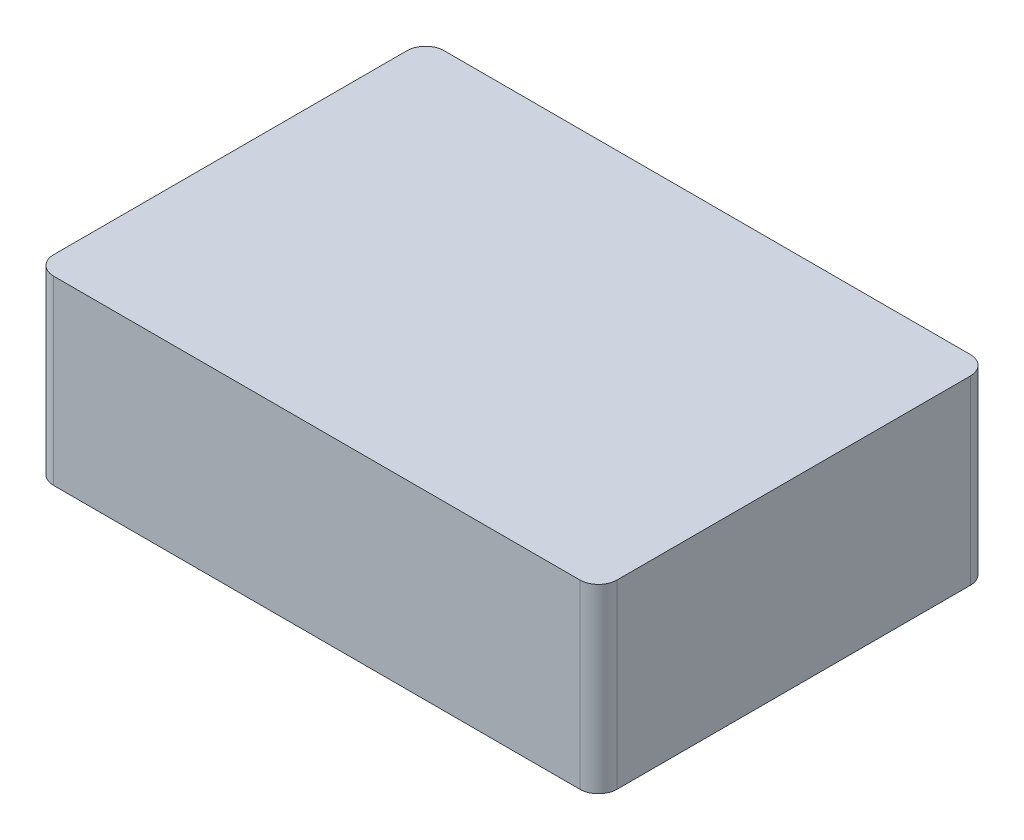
from build123d import *

# Parameters (mm, degrees)
SKETCH1_W                 = 76.962
SKETCH1_H                 = 53.34
BOSS_EXTRUDE1_DEPTH       = 24.765
FILLET1_R                 = 2.54
SHELL1_T                  = -3.81
SKETCH2_R                 = 3.175
BOSS_EXTRUDE2_DEPTH       = 20.955
F_4_CLEARANCE_HOLE1_D     = 2.9464
F_4_CLEARANCE_HOLE1_DEPTH = 7.62
F_4_CLEARANCE_HOLE1_TIP   = 0.885187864


with BuildPart() as part:
    # Sketch1 → Boss-Extrude1 (new body)
    with BuildSketch(Plane(origin=(0, 0, 0), x_dir=(1, 0, 0), z_dir=(0, 1, 0))):
        Rectangle(SKETCH1_W, SKETCH1_H)
    extrude(amount=BOSS_EXTRUDE1_DEPTH)

    # Fillet1
    fillet1_edges = [part.edges().sort_by_distance(p)[0] for p in [
        (-38.481, 12.3825, -26.67),
        (38.481, 12.3825, -26.67),
        (38.481, 12.3825, 26.67),
        (-38.481, 12.3825, 26.67),
    ]]
    fillet(fillet1_edges, radius=FILLET1_R)

    # Shell1
    shell1_openings = [part.faces().sort_by_distance(p)[0] for p in [
        (0, 0, 0),
    ]]
    offset(amount=SHELL1_T, openings=shell1_openings, kind=Kind.INTERSECTION)

    # Sketch2 → Boss-Extrude2 (add)
    with BuildSketch(Plane.XZ):
        with Locations((30.988, -22.352)):
            Circle(SKETCH2_R)
        with Locations((30.988, 22.352)):
            Circle(SKETCH2_R)
        with Locations((-30.988, -22.352)):
            Circle(SKETCH2_R)
        with Locations((-30.988, 22.352)):
            Circle(SKETCH2_R)
    extrude(amount=-BOSS_EXTRUDE2_DEPTH)

    # 4 Clearance Hole1
    with Locations(Plane(origin=(0, 0, 0), x_dir=(-1, 0, 0), z_dir=(0, -1, 0))):
        with Locations((30.988, -22.352), (-30.988, -22.352), (30.988, 22.352), (-30.988, 22.352)):
            Hole(F_4_CLEARANCE_HOLE1_D / 2, depth=F_4_CLEARANCE_HOLE1_DEPTH)
            with Locations((0, 0, -(F_4_CLEARANCE_HOLE1_DEPTH + F_4_CLEARANCE_HOLE1_TIP / 2))):  # 118° drill point
                Cone(0, F_4_CLEARANCE_HOLE1_D / 2, F_4_CLEARANCE_HOLE1_TIP, mode=Mode.SUBTRACT)


solid = part.part
